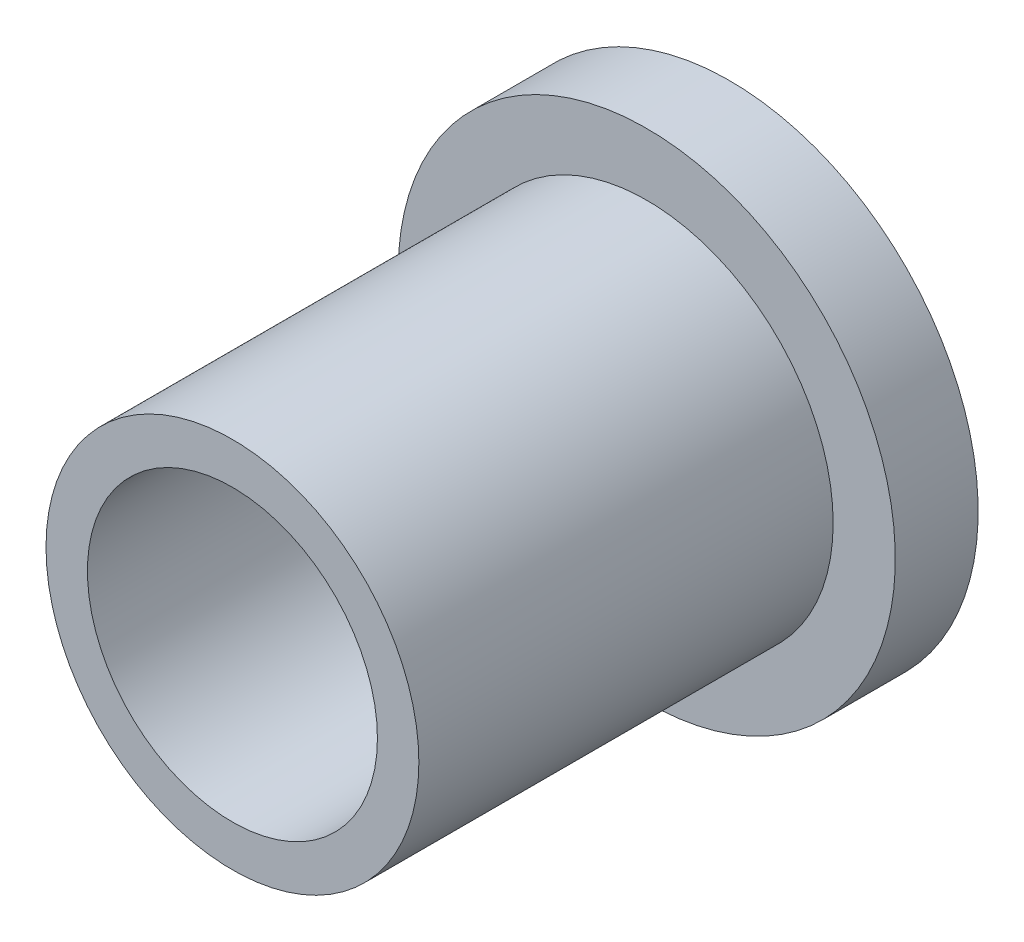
ISO-10303-21;
HEADER;
FILE_DESCRIPTION(('STEP AP214'),'2;1');
FILE_NAME('part.step','',(''),(''),'','','');
FILE_SCHEMA(('AUTOMOTIVE_DESIGN { 1 0 10303 214 1 1 1 1 }'));
ENDSEC;
DATA;
#1=APPLICATION_CONTEXT('core data for automotive mechanical design processes');
#2=APPLICATION_PROTOCOL_DEFINITION('international standard','automotive_design',2000,#1);
#3=PRODUCT_CONTEXT('',#1,'mechanical');
#4=PRODUCT('Part','Part','',(#3));
#5=PRODUCT_RELATED_PRODUCT_CATEGORY('part','',(#4));
#6=PRODUCT_DEFINITION_FORMATION('','',#4);
#7=PRODUCT_DEFINITION_CONTEXT('part definition',#1,'design');
#8=PRODUCT_DEFINITION('design','',#6,#7);
#9=PRODUCT_DEFINITION_SHAPE('','',#8);
#10=(LENGTH_UNIT() NAMED_UNIT(*) SI_UNIT(.MILLI.,.METRE.));
#11=(NAMED_UNIT(*) PLANE_ANGLE_UNIT() SI_UNIT($,.RADIAN.));
#12=(NAMED_UNIT(*) SI_UNIT($,.STERADIAN.) SOLID_ANGLE_UNIT());
#13=UNCERTAINTY_MEASURE_WITH_UNIT(LENGTH_MEASURE(1.E-05),#10,'distance_accuracy_value','');
#14=(GEOMETRIC_REPRESENTATION_CONTEXT(3) GLOBAL_UNCERTAINTY_ASSIGNED_CONTEXT((#13)) GLOBAL_UNIT_ASSIGNED_CONTEXT((#10,
#11,#12)) REPRESENTATION_CONTEXT('',''));
#15=CARTESIAN_POINT('',(0.,0.,0.));
#16=DIRECTION('',(0.,0.,1.));
#17=DIRECTION('',(1.,0.,0.));
#18=AXIS2_PLACEMENT_3D('',#15,#16,#17);
#19=CARTESIAN_POINT('',(0.,0.,6.));
#20=DIRECTION('',(0.,0.,-1.));
#21=DIRECTION('',(-1.,0.,0.));
#22=AXIS2_PLACEMENT_3D('',#19,#20,#21);
#23=CYLINDRICAL_SURFACE('',#22,2.25);
#24=CARTESIAN_POINT('',(0.,0.,6.));
#25=DIRECTION('',(0.,0.,1.));
#26=DIRECTION('',(1.,0.,0.));
#27=AXIS2_PLACEMENT_3D('',#24,#25,#26);
#28=CIRCLE('',#27,2.25);
#29=CARTESIAN_POINT('',(2.25,0.,6.));
#30=VERTEX_POINT('',#29);
#31=EDGE_CURVE('E32',#30,#30,#28,.T.);
#32=ORIENTED_EDGE('',*,*,#31,.F.);
#33=EDGE_LOOP('',(#32));
#34=FACE_BOUND('',#33,.T.);
#35=CARTESIAN_POINT('',(0.,0.,1.));
#36=DIRECTION('',(0.,0.,-1.));
#37=DIRECTION('',(-1.,0.,0.));
#38=AXIS2_PLACEMENT_3D('',#35,#36,#37);
#39=CIRCLE('',#38,2.25);
#40=CARTESIAN_POINT('',(-2.25,0.,1.));
#41=VERTEX_POINT('',#40);
#42=EDGE_CURVE('E10',#41,#41,#39,.T.);
#43=ORIENTED_EDGE('',*,*,#42,.F.);
#44=EDGE_LOOP('',(#43));
#45=FACE_BOUND('',#44,.T.);
#46=ADVANCED_FACE('F29',(#34,#45),#23,.T.);
#47=CARTESIAN_POINT('',(0.,0.,6.));
#48=DIRECTION('',(0.,0.,1.));
#49=DIRECTION('',(1.,0.,0.));
#50=AXIS2_PLACEMENT_3D('',#47,#48,#49);
#51=PLANE('',#50);
#52=ORIENTED_EDGE('',*,*,#31,.T.);
#53=EDGE_LOOP('',(#52));
#54=FACE_BOUND('',#53,.T.);
#55=CARTESIAN_POINT('',(0.,0.,6.));
#56=DIRECTION('',(0.,0.,1.));
#57=DIRECTION('',(1.,0.,0.));
#58=AXIS2_PLACEMENT_3D('',#55,#56,#57);
#59=CIRCLE('',#58,1.75);
#60=CARTESIAN_POINT('',(1.75,0.,6.));
#61=VERTEX_POINT('',#60);
#62=EDGE_CURVE('E40',#61,#61,#59,.T.);
#63=ORIENTED_EDGE('',*,*,#62,.F.);
#64=EDGE_LOOP('',(#63));
#65=FACE_BOUND('',#64,.T.);
#66=ADVANCED_FACE('F71',(#54,#65),#51,.T.);
#67=CARTESIAN_POINT('',(0.,0.,0.));
#68=DIRECTION('',(0.,0.,1.));
#69=DIRECTION('',(1.,0.,0.));
#70=AXIS2_PLACEMENT_3D('',#67,#68,#69);
#71=PLANE('',#70);
#72=CARTESIAN_POINT('',(0.,0.,0.));
#73=DIRECTION('',(0.,0.,1.));
#74=DIRECTION('',(1.,0.,0.));
#75=AXIS2_PLACEMENT_3D('',#72,#73,#74);
#76=CIRCLE('',#75,1.75);
#77=CARTESIAN_POINT('',(1.75,0.,0.));
#78=VERTEX_POINT('',#77);
#79=EDGE_CURVE('E46',#78,#78,#76,.T.);
#80=ORIENTED_EDGE('',*,*,#79,.T.);
#81=EDGE_LOOP('',(#80));
#82=FACE_BOUND('',#81,.T.);
#83=CARTESIAN_POINT('',(0.,0.,0.));
#84=DIRECTION('',(0.,0.,-1.));
#85=DIRECTION('',(-1.,0.,0.));
#86=AXIS2_PLACEMENT_3D('',#83,#84,#85);
#87=CIRCLE('',#86,3.);
#88=CARTESIAN_POINT('',(-3.,0.,0.));
#89=VERTEX_POINT('',#88);
#90=EDGE_CURVE('E43',#89,#89,#87,.T.);
#91=ORIENTED_EDGE('',*,*,#90,.T.);
#92=EDGE_LOOP('',(#91));
#93=FACE_BOUND('',#92,.T.);
#94=ADVANCED_FACE('F57',(#82,#93),#71,.F.);
#95=CARTESIAN_POINT('',(0.,0.,6.));
#96=DIRECTION('',(0.,0.,-1.));
#97=DIRECTION('',(-1.,0.,0.));
#98=AXIS2_PLACEMENT_3D('',#95,#96,#97);
#99=CYLINDRICAL_SURFACE('',#98,1.75);
#100=ORIENTED_EDGE('',*,*,#79,.F.);
#101=EDGE_LOOP('',(#100));
#102=FACE_BOUND('',#101,.T.);
#103=ORIENTED_EDGE('',*,*,#62,.T.);
#104=EDGE_LOOP('',(#103));
#105=FACE_BOUND('',#104,.T.);
#106=ADVANCED_FACE('F66',(#102,#105),#99,.F.);
#107=CARTESIAN_POINT('',(0.,0.,1.));
#108=DIRECTION('',(0.,0.,-1.));
#109=DIRECTION('',(-1.,0.,0.));
#110=AXIS2_PLACEMENT_3D('',#107,#108,#109);
#111=PLANE('',#110);
#112=CARTESIAN_POINT('',(0.,0.,1.));
#113=DIRECTION('',(0.,0.,-1.));
#114=DIRECTION('',(-1.,0.,0.));
#115=AXIS2_PLACEMENT_3D('',#112,#113,#114);
#116=CIRCLE('',#115,3.);
#117=CARTESIAN_POINT('',(-3.,0.,1.));
#118=VERTEX_POINT('',#117);
#119=EDGE_CURVE('E48',#118,#118,#116,.T.);
#120=ORIENTED_EDGE('',*,*,#119,.F.);
#121=EDGE_LOOP('',(#120));
#122=FACE_BOUND('',#121,.T.);
#123=ORIENTED_EDGE('',*,*,#42,.T.);
#124=EDGE_LOOP('',(#123));
#125=FACE_BOUND('',#124,.T.);
#126=ADVANCED_FACE('F61',(#122,#125),#111,.F.);
#127=CARTESIAN_POINT('',(0.,0.,1.));
#128=DIRECTION('',(0.,0.,-1.));
#129=DIRECTION('',(-1.,0.,0.));
#130=AXIS2_PLACEMENT_3D('',#127,#128,#129);
#131=CYLINDRICAL_SURFACE('',#130,3.);
#132=ORIENTED_EDGE('',*,*,#119,.T.);
#133=EDGE_LOOP('',(#132));
#134=FACE_BOUND('',#133,.T.);
#135=ORIENTED_EDGE('',*,*,#90,.F.);
#136=EDGE_LOOP('',(#135));
#137=FACE_BOUND('',#136,.T.);
#138=ADVANCED_FACE('F59',(#134,#137),#131,.T.);
#139=CLOSED_SHELL('',(#46,#66,#94,#106,#126,#138));
#140=MANIFOLD_SOLID_BREP('B2',#139);
#141=ADVANCED_BREP_SHAPE_REPRESENTATION('',(#18,#140),#14);
#142=SHAPE_DEFINITION_REPRESENTATION(#9,#141);
ENDSEC;
END-ISO-10303-21;
